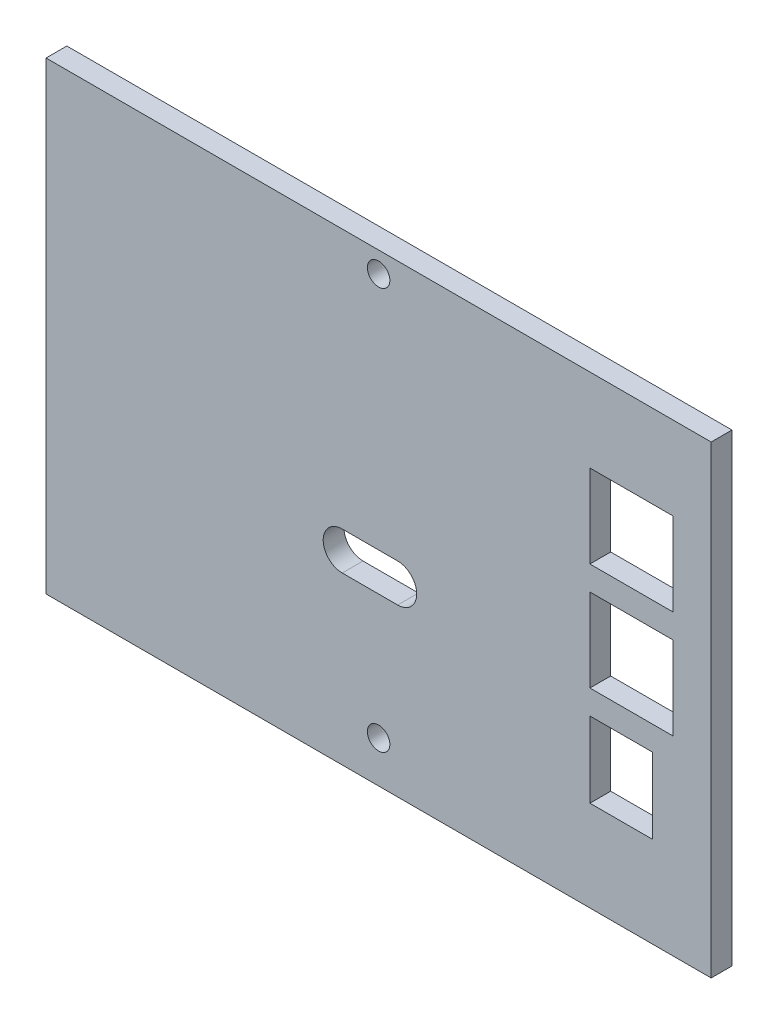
ISO-10303-21;
HEADER;
FILE_DESCRIPTION(('STEP AP214'),'2;1');
FILE_NAME('part.step','',(''),(''),'','','');
FILE_SCHEMA(('AUTOMOTIVE_DESIGN { 1 0 10303 214 1 1 1 1 }'));
ENDSEC;
DATA;
#1=APPLICATION_CONTEXT('core data for automotive mechanical design processes');
#2=APPLICATION_PROTOCOL_DEFINITION('international standard','automotive_design',2000,#1);
#3=PRODUCT_CONTEXT('',#1,'mechanical');
#4=PRODUCT('Part','Part','',(#3));
#5=PRODUCT_RELATED_PRODUCT_CATEGORY('part','',(#4));
#6=PRODUCT_DEFINITION_FORMATION('','',#4);
#7=PRODUCT_DEFINITION_CONTEXT('part definition',#1,'design');
#8=PRODUCT_DEFINITION('design','',#6,#7);
#9=PRODUCT_DEFINITION_SHAPE('','',#8);
#10=(LENGTH_UNIT() NAMED_UNIT(*) SI_UNIT(.MILLI.,.METRE.));
#11=(NAMED_UNIT(*) PLANE_ANGLE_UNIT() SI_UNIT($,.RADIAN.));
#12=(NAMED_UNIT(*) SI_UNIT($,.STERADIAN.) SOLID_ANGLE_UNIT());
#13=UNCERTAINTY_MEASURE_WITH_UNIT(LENGTH_MEASURE(1.E-05),#10,'distance_accuracy_value','');
#14=(GEOMETRIC_REPRESENTATION_CONTEXT(3) GLOBAL_UNCERTAINTY_ASSIGNED_CONTEXT((#13)) GLOBAL_UNIT_ASSIGNED_CONTEXT((#10,
#11,#12)) REPRESENTATION_CONTEXT('',''));
#15=CARTESIAN_POINT('',(0.,0.,0.));
#16=DIRECTION('',(0.,0.,1.));
#17=DIRECTION('',(1.,0.,0.));
#18=AXIS2_PLACEMENT_3D('',#15,#16,#17);
#19=CARTESIAN_POINT('',(0.,0.,3.));
#20=DIRECTION('',(0.,0.,-1.));
#21=DIRECTION('',(-1.,0.,0.));
#22=AXIS2_PLACEMENT_3D('',#19,#20,#21);
#23=PLANE('',#22);
#24=DIRECTION('',(0.,1.,0.));
#25=VECTOR('',#24,1.);
#26=CARTESIAN_POINT('',(39.5,-9.5,3.));
#27=LINE('',#26,#25);
#28=CARTESIAN_POINT('',(39.5,-20.4,3.));
#29=VERTEX_POINT('',#28);
#30=CARTESIAN_POINT('',(39.5,-9.5,3.));
#31=VERTEX_POINT('',#30);
#32=EDGE_CURVE('E228',#29,#31,#27,.T.);
#33=ORIENTED_EDGE('',*,*,#32,.F.);
#34=DIRECTION('',(1.,0.,0.));
#35=VECTOR('',#34,1.);
#36=CARTESIAN_POINT('',(30.5,-20.4,3.));
#37=LINE('',#36,#35);
#38=CARTESIAN_POINT('',(30.5,-20.4,3.));
#39=VERTEX_POINT('',#38);
#40=EDGE_CURVE('E223',#39,#29,#37,.T.);
#41=ORIENTED_EDGE('',*,*,#40,.F.);
#42=DIRECTION('',(0.,-1.,0.));
#43=VECTOR('',#42,1.);
#44=CARTESIAN_POINT('',(30.5,-9.5,3.));
#45=LINE('',#44,#43);
#46=CARTESIAN_POINT('',(30.5,-9.5,3.));
#47=VERTEX_POINT('',#46);
#48=EDGE_CURVE('E239',#47,#39,#45,.T.);
#49=ORIENTED_EDGE('',*,*,#48,.F.);
#50=DIRECTION('',(-1.,0.,0.));
#51=VECTOR('',#50,1.);
#52=CARTESIAN_POINT('',(30.5,-9.5,3.));
#53=LINE('',#52,#51);
#54=EDGE_CURVE('E241',#31,#47,#53,.T.);
#55=ORIENTED_EDGE('',*,*,#54,.F.);
#56=EDGE_LOOP('',(#33,#41,#49,#55));
#57=FACE_BOUND('',#56,.T.);
#58=DIRECTION('',(0.,-1.,0.));
#59=VECTOR('',#58,1.);
#60=CARTESIAN_POINT('',(30.5,21.5,3.));
#61=LINE('',#60,#59);
#62=CARTESIAN_POINT('',(30.5,21.5,3.));
#63=VERTEX_POINT('',#62);
#64=CARTESIAN_POINT('',(30.5,9.49999999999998,3.));
#65=VERTEX_POINT('',#64);
#66=EDGE_CURVE('E284',#63,#65,#61,.T.);
#67=ORIENTED_EDGE('',*,*,#66,.F.);
#68=DIRECTION('',(-1.,0.,0.));
#69=VECTOR('',#68,1.);
#70=CARTESIAN_POINT('',(42.5,21.5,3.));
#71=LINE('',#70,#69);
#72=CARTESIAN_POINT('',(42.5,21.5,3.));
#73=VERTEX_POINT('',#72);
#74=EDGE_CURVE('E292',#73,#63,#71,.T.);
#75=ORIENTED_EDGE('',*,*,#74,.F.);
#76=DIRECTION('',(0.,1.,0.));
#77=VECTOR('',#76,1.);
#78=CARTESIAN_POINT('',(42.5,21.5,3.));
#79=LINE('',#78,#77);
#80=CARTESIAN_POINT('',(42.5,9.49999999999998,3.));
#81=VERTEX_POINT('',#80);
#82=EDGE_CURVE('E289',#81,#73,#79,.T.);
#83=ORIENTED_EDGE('',*,*,#82,.F.);
#84=DIRECTION('',(1.,0.,0.));
#85=VECTOR('',#84,1.);
#86=CARTESIAN_POINT('',(42.5,9.49999999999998,3.));
#87=LINE('',#86,#85);
#88=EDGE_CURVE('E286',#65,#81,#87,.T.);
#89=ORIENTED_EDGE('',*,*,#88,.F.);
#90=EDGE_LOOP('',(#67,#75,#83,#89));
#91=FACE_BOUND('',#90,.T.);
#92=DIRECTION('',(0.,1.,0.));
#93=VECTOR('',#92,1.);
#94=CARTESIAN_POINT('',(48.,-33.5,3.));
#95=LINE('',#94,#93);
#96=CARTESIAN_POINT('',(48.,-33.5,3.));
#97=VERTEX_POINT('',#96);
#98=CARTESIAN_POINT('',(48.,33.5,3.));
#99=VERTEX_POINT('',#98);
#100=EDGE_CURVE('E315',#97,#99,#95,.T.);
#101=ORIENTED_EDGE('',*,*,#100,.T.);
#102=DIRECTION('',(-1.,0.,0.));
#103=VECTOR('',#102,1.);
#104=CARTESIAN_POINT('',(-48.,33.5,3.));
#105=LINE('',#104,#103);
#106=CARTESIAN_POINT('',(-48.,33.5,3.));
#107=VERTEX_POINT('',#106);
#108=EDGE_CURVE('E318',#99,#107,#105,.T.);
#109=ORIENTED_EDGE('',*,*,#108,.T.);
#110=DIRECTION('',(0.,-1.,0.));
#111=VECTOR('',#110,1.);
#112=CARTESIAN_POINT('',(-48.,-33.5,3.));
#113=LINE('',#112,#111);
#114=CARTESIAN_POINT('',(-48.,-33.5,3.));
#115=VERTEX_POINT('',#114);
#116=EDGE_CURVE('E321',#107,#115,#113,.T.);
#117=ORIENTED_EDGE('',*,*,#116,.T.);
#118=DIRECTION('',(1.,0.,0.));
#119=VECTOR('',#118,1.);
#120=CARTESIAN_POINT('',(-48.,-33.5,3.));
#121=LINE('',#120,#119);
#122=EDGE_CURVE('E323',#115,#97,#121,.T.);
#123=ORIENTED_EDGE('',*,*,#122,.T.);
#124=EDGE_LOOP('',(#101,#109,#117,#123));
#125=FACE_BOUND('',#124,.T.);
#126=DIRECTION('',(0.,-1.,0.));
#127=VECTOR('',#126,1.);
#128=CARTESIAN_POINT('',(30.5,5.99999999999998,3.));
#129=LINE('',#128,#127);
#130=CARTESIAN_POINT('',(30.5,5.99999999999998,3.));
#131=VERTEX_POINT('',#130);
#132=CARTESIAN_POINT('',(30.5,-6.00000000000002,3.));
#133=VERTEX_POINT('',#132);
#134=EDGE_CURVE('E195',#131,#133,#129,.T.);
#135=ORIENTED_EDGE('',*,*,#134,.F.);
#136=DIRECTION('',(-1.,0.,0.));
#137=VECTOR('',#136,1.);
#138=CARTESIAN_POINT('',(42.5,5.99999999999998,3.));
#139=LINE('',#138,#137);
#140=CARTESIAN_POINT('',(42.5,5.99999999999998,3.));
#141=VERTEX_POINT('',#140);
#142=EDGE_CURVE('E207',#141,#131,#139,.T.);
#143=ORIENTED_EDGE('',*,*,#142,.F.);
#144=DIRECTION('',(0.,1.,0.));
#145=VECTOR('',#144,1.);
#146=CARTESIAN_POINT('',(42.5,5.99999999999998,3.));
#147=LINE('',#146,#145);
#148=CARTESIAN_POINT('',(42.5,-6.00000000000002,3.));
#149=VERTEX_POINT('',#148);
#150=EDGE_CURVE('E182',#149,#141,#147,.T.);
#151=ORIENTED_EDGE('',*,*,#150,.F.);
#152=DIRECTION('',(1.,0.,0.));
#153=VECTOR('',#152,1.);
#154=CARTESIAN_POINT('',(42.5,-6.00000000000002,3.));
#155=LINE('',#154,#153);
#156=EDGE_CURVE('E210',#133,#149,#155,.T.);
#157=ORIENTED_EDGE('',*,*,#156,.F.);
#158=EDGE_LOOP('',(#135,#143,#151,#157));
#159=FACE_BOUND('',#158,.T.);
#160=CARTESIAN_POINT('',(2.75,-6.75,3.));
#161=DIRECTION('',(0.,0.,1.));
#162=DIRECTION('',(1.,0.,0.));
#163=AXIS2_PLACEMENT_3D('',#160,#161,#162);
#164=CIRCLE('',#163,2.75);
#165=CARTESIAN_POINT('',(2.75,-9.50000000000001,3.));
#166=VERTEX_POINT('',#165);
#167=CARTESIAN_POINT('',(2.75,-4.00000000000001,3.));
#168=VERTEX_POINT('',#167);
#169=EDGE_CURVE('E259',#166,#168,#164,.T.);
#170=ORIENTED_EDGE('',*,*,#169,.F.);
#171=DIRECTION('',(1.,0.,0.));
#172=VECTOR('',#171,1.);
#173=CARTESIAN_POINT('',(2.75,-9.50000000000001,3.));
#174=LINE('',#173,#172);
#175=CARTESIAN_POINT('',(-5.25,-9.50000000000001,3.));
#176=VERTEX_POINT('',#175);
#177=EDGE_CURVE('E254',#176,#166,#174,.T.);
#178=ORIENTED_EDGE('',*,*,#177,.F.);
#179=CARTESIAN_POINT('',(-5.25,-6.75000000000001,3.));
#180=DIRECTION('',(0.,0.,1.));
#181=DIRECTION('',(1.,0.,0.));
#182=AXIS2_PLACEMENT_3D('',#179,#180,#181);
#183=CIRCLE('',#182,2.75);
#184=CARTESIAN_POINT('',(-5.25,-4.,3.));
#185=VERTEX_POINT('',#184);
#186=EDGE_CURVE('E268',#185,#176,#183,.T.);
#187=ORIENTED_EDGE('',*,*,#186,.F.);
#188=DIRECTION('',(-1.,0.,0.));
#189=VECTOR('',#188,1.);
#190=CARTESIAN_POINT('',(2.75,-4.00000000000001,3.));
#191=LINE('',#190,#189);
#192=EDGE_CURVE('E270',#168,#185,#191,.T.);
#193=ORIENTED_EDGE('',*,*,#192,.F.);
#194=EDGE_LOOP('',(#170,#178,#187,#193));
#195=FACE_BOUND('',#194,.T.);
#196=CARTESIAN_POINT('',(0.,-27.5000000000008,3.));
#197=DIRECTION('',(0.,0.,1.));
#198=DIRECTION('',(1.,0.,0.));
#199=AXIS2_PLACEMENT_3D('',#196,#197,#198);
#200=CIRCLE('',#199,1.625);
#201=CARTESIAN_POINT('',(1.62500000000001,-27.5000000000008,3.));
#202=VERTEX_POINT('',#201);
#203=EDGE_CURVE('E275',#202,#202,#200,.T.);
#204=ORIENTED_EDGE('',*,*,#203,.F.);
#205=EDGE_LOOP('',(#204));
#206=FACE_BOUND('',#205,.T.);
#207=CARTESIAN_POINT('',(0.,30.5,3.));
#208=DIRECTION('',(0.,0.,1.));
#209=DIRECTION('',(1.,0.,0.));
#210=AXIS2_PLACEMENT_3D('',#207,#208,#209);
#211=CIRCLE('',#210,1.625);
#212=CARTESIAN_POINT('',(1.62499999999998,30.5,3.));
#213=VERTEX_POINT('',#212);
#214=EDGE_CURVE('E281',#213,#213,#211,.T.);
#215=ORIENTED_EDGE('',*,*,#214,.F.);
#216=EDGE_LOOP('',(#215));
#217=FACE_BOUND('',#216,.T.);
#218=ADVANCED_FACE('F37',(#57,#91,#125,#159,#195,#206,#217),#23,.F.);
#219=CARTESIAN_POINT('',(0.,0.,0.));
#220=DIRECTION('',(0.,0.,-1.));
#221=DIRECTION('',(-1.,0.,0.));
#222=AXIS2_PLACEMENT_3D('',#219,#220,#221);
#223=PLANE('',#222);
#224=CARTESIAN_POINT('',(0.,-27.5000000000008,0.));
#225=DIRECTION('',(0.,0.,1.));
#226=DIRECTION('',(1.,0.,0.));
#227=AXIS2_PLACEMENT_3D('',#224,#225,#226);
#228=CIRCLE('',#227,1.625);
#229=CARTESIAN_POINT('',(1.62500000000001,-27.5000000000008,0.));
#230=VERTEX_POINT('',#229);
#231=EDGE_CURVE('E248',#230,#230,#228,.T.);
#232=ORIENTED_EDGE('',*,*,#231,.T.);
#233=EDGE_LOOP('',(#232));
#234=FACE_BOUND('',#233,.T.);
#235=DIRECTION('',(0.,1.,0.));
#236=VECTOR('',#235,1.);
#237=CARTESIAN_POINT('',(48.,-33.5,0.));
#238=LINE('',#237,#236);
#239=CARTESIAN_POINT('',(48.,-33.5,0.));
#240=VERTEX_POINT('',#239);
#241=CARTESIAN_POINT('',(48.,33.5,0.));
#242=VERTEX_POINT('',#241);
#243=EDGE_CURVE('E314',#240,#242,#238,.T.);
#244=ORIENTED_EDGE('',*,*,#243,.F.);
#245=DIRECTION('',(1.,0.,0.));
#246=VECTOR('',#245,1.);
#247=CARTESIAN_POINT('',(-48.,-33.5,0.));
#248=LINE('',#247,#246);
#249=CARTESIAN_POINT('',(-48.,-33.5,0.));
#250=VERTEX_POINT('',#249);
#251=EDGE_CURVE('E319',#250,#240,#248,.T.);
#252=ORIENTED_EDGE('',*,*,#251,.F.);
#253=DIRECTION('',(0.,-1.,0.));
#254=VECTOR('',#253,1.);
#255=CARTESIAN_POINT('',(-48.,-33.5,0.));
#256=LINE('',#255,#254);
#257=CARTESIAN_POINT('',(-48.,33.5,0.));
#258=VERTEX_POINT('',#257);
#259=EDGE_CURVE('E330',#258,#250,#256,.T.);
#260=ORIENTED_EDGE('',*,*,#259,.F.);
#261=DIRECTION('',(-1.,0.,0.));
#262=VECTOR('',#261,1.);
#263=CARTESIAN_POINT('',(-48.,33.5,0.));
#264=LINE('',#263,#262);
#265=EDGE_CURVE('E328',#242,#258,#264,.T.);
#266=ORIENTED_EDGE('',*,*,#265,.F.);
#267=EDGE_LOOP('',(#244,#252,#260,#266));
#268=FACE_BOUND('',#267,.T.);
#269=DIRECTION('',(-1.,0.,0.));
#270=VECTOR('',#269,1.);
#271=CARTESIAN_POINT('',(42.5,21.5,0.));
#272=LINE('',#271,#270);
#273=CARTESIAN_POINT('',(42.5,21.5,0.));
#274=VERTEX_POINT('',#273);
#275=CARTESIAN_POINT('',(30.5,21.5,0.));
#276=VERTEX_POINT('',#275);
#277=EDGE_CURVE('E287',#274,#276,#272,.T.);
#278=ORIENTED_EDGE('',*,*,#277,.T.);
#279=DIRECTION('',(0.,-1.,0.));
#280=VECTOR('',#279,1.);
#281=CARTESIAN_POINT('',(30.5,21.5,0.));
#282=LINE('',#281,#280);
#283=CARTESIAN_POINT('',(30.5,9.49999999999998,0.));
#284=VERTEX_POINT('',#283);
#285=EDGE_CURVE('E206',#276,#284,#282,.T.);
#286=ORIENTED_EDGE('',*,*,#285,.T.);
#287=DIRECTION('',(1.,0.,0.));
#288=VECTOR('',#287,1.);
#289=CARTESIAN_POINT('',(42.5,9.49999999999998,0.));
#290=LINE('',#289,#288);
#291=CARTESIAN_POINT('',(42.5,9.49999999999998,0.));
#292=VERTEX_POINT('',#291);
#293=EDGE_CURVE('E297',#284,#292,#290,.T.);
#294=ORIENTED_EDGE('',*,*,#293,.T.);
#295=DIRECTION('',(0.,1.,0.));
#296=VECTOR('',#295,1.);
#297=CARTESIAN_POINT('',(42.5,21.5,0.));
#298=LINE('',#297,#296);
#299=EDGE_CURVE('E300',#292,#274,#298,.T.);
#300=ORIENTED_EDGE('',*,*,#299,.T.);
#301=EDGE_LOOP('',(#278,#286,#294,#300));
#302=FACE_BOUND('',#301,.T.);
#303=DIRECTION('',(-1.,0.,0.));
#304=VECTOR('',#303,1.);
#305=CARTESIAN_POINT('',(42.5,5.99999999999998,0.));
#306=LINE('',#305,#304);
#307=CARTESIAN_POINT('',(42.5,5.99999999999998,0.));
#308=VERTEX_POINT('',#307);
#309=CARTESIAN_POINT('',(30.5,5.99999999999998,0.));
#310=VERTEX_POINT('',#309);
#311=EDGE_CURVE('E190',#308,#310,#306,.T.);
#312=ORIENTED_EDGE('',*,*,#311,.T.);
#313=DIRECTION('',(0.,-1.,0.));
#314=VECTOR('',#313,1.);
#315=CARTESIAN_POINT('',(30.5,5.99999999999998,0.));
#316=LINE('',#315,#314);
#317=CARTESIAN_POINT('',(30.5,-6.00000000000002,0.));
#318=VERTEX_POINT('',#317);
#319=EDGE_CURVE('E201',#310,#318,#316,.T.);
#320=ORIENTED_EDGE('',*,*,#319,.T.);
#321=DIRECTION('',(1.,0.,0.));
#322=VECTOR('',#321,1.);
#323=CARTESIAN_POINT('',(42.5,-6.00000000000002,0.));
#324=LINE('',#323,#322);
#325=CARTESIAN_POINT('',(42.5,-6.00000000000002,0.));
#326=VERTEX_POINT('',#325);
#327=EDGE_CURVE('E199',#318,#326,#324,.T.);
#328=ORIENTED_EDGE('',*,*,#327,.T.);
#329=DIRECTION('',(0.,1.,0.));
#330=VECTOR('',#329,1.);
#331=CARTESIAN_POINT('',(42.5,5.99999999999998,0.));
#332=LINE('',#331,#330);
#333=EDGE_CURVE('E179',#326,#308,#332,.T.);
#334=ORIENTED_EDGE('',*,*,#333,.T.);
#335=EDGE_LOOP('',(#312,#320,#328,#334));
#336=FACE_BOUND('',#335,.T.);
#337=DIRECTION('',(1.,0.,0.));
#338=VECTOR('',#337,1.);
#339=CARTESIAN_POINT('',(30.5,-20.4,0.));
#340=LINE('',#339,#338);
#341=CARTESIAN_POINT('',(30.5,-20.4,0.));
#342=VERTEX_POINT('',#341);
#343=CARTESIAN_POINT('',(39.5,-20.4,0.));
#344=VERTEX_POINT('',#343);
#345=EDGE_CURVE('E224',#342,#344,#340,.T.);
#346=ORIENTED_EDGE('',*,*,#345,.T.);
#347=DIRECTION('',(0.,1.,0.));
#348=VECTOR('',#347,1.);
#349=CARTESIAN_POINT('',(39.5,-9.5,0.));
#350=LINE('',#349,#348);
#351=CARTESIAN_POINT('',(39.5,-9.5,0.));
#352=VERTEX_POINT('',#351);
#353=EDGE_CURVE('E234',#344,#352,#350,.T.);
#354=ORIENTED_EDGE('',*,*,#353,.T.);
#355=DIRECTION('',(-1.,0.,0.));
#356=VECTOR('',#355,1.);
#357=CARTESIAN_POINT('',(30.5,-9.5,0.));
#358=LINE('',#357,#356);
#359=CARTESIAN_POINT('',(30.5,-9.5,0.));
#360=VERTEX_POINT('',#359);
#361=EDGE_CURVE('E231',#352,#360,#358,.T.);
#362=ORIENTED_EDGE('',*,*,#361,.T.);
#363=DIRECTION('',(0.,-1.,0.));
#364=VECTOR('',#363,1.);
#365=CARTESIAN_POINT('',(30.5,-9.5,0.));
#366=LINE('',#365,#364);
#367=EDGE_CURVE('E227',#360,#342,#366,.T.);
#368=ORIENTED_EDGE('',*,*,#367,.T.);
#369=EDGE_LOOP('',(#346,#354,#362,#368));
#370=FACE_BOUND('',#369,.T.);
#371=DIRECTION('',(1.,0.,0.));
#372=VECTOR('',#371,1.);
#373=CARTESIAN_POINT('',(2.75,-9.50000000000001,0.));
#374=LINE('',#373,#372);
#375=CARTESIAN_POINT('',(-5.25,-9.50000000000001,0.));
#376=VERTEX_POINT('',#375);
#377=CARTESIAN_POINT('',(2.75,-9.50000000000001,0.));
#378=VERTEX_POINT('',#377);
#379=EDGE_CURVE('E255',#376,#378,#374,.T.);
#380=ORIENTED_EDGE('',*,*,#379,.T.);
#381=CARTESIAN_POINT('',(2.75,-6.75,0.));
#382=DIRECTION('',(0.,0.,1.));
#383=DIRECTION('',(1.,0.,0.));
#384=AXIS2_PLACEMENT_3D('',#381,#382,#383);
#385=CIRCLE('',#384,2.75);
#386=CARTESIAN_POINT('',(2.75,-4.00000000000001,0.));
#387=VERTEX_POINT('',#386);
#388=EDGE_CURVE('E217',#378,#387,#385,.T.);
#389=ORIENTED_EDGE('',*,*,#388,.T.);
#390=DIRECTION('',(-1.,0.,0.));
#391=VECTOR('',#390,1.);
#392=CARTESIAN_POINT('',(2.75,-4.00000000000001,0.));
#393=LINE('',#392,#391);
#394=CARTESIAN_POINT('',(-5.25,-4.,0.));
#395=VERTEX_POINT('',#394);
#396=EDGE_CURVE('E262',#387,#395,#393,.T.);
#397=ORIENTED_EDGE('',*,*,#396,.T.);
#398=CARTESIAN_POINT('',(-5.25,-6.75000000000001,0.));
#399=DIRECTION('',(0.,0.,1.));
#400=DIRECTION('',(1.,0.,0.));
#401=AXIS2_PLACEMENT_3D('',#398,#399,#400);
#402=CIRCLE('',#401,2.75);
#403=EDGE_CURVE('E258',#395,#376,#402,.T.);
#404=ORIENTED_EDGE('',*,*,#403,.T.);
#405=EDGE_LOOP('',(#380,#389,#397,#404));
#406=FACE_BOUND('',#405,.T.);
#407=CARTESIAN_POINT('',(0.,30.5,0.));
#408=DIRECTION('',(0.,0.,1.));
#409=DIRECTION('',(1.,0.,0.));
#410=AXIS2_PLACEMENT_3D('',#407,#408,#409);
#411=CIRCLE('',#410,1.625);
#412=CARTESIAN_POINT('',(1.62499999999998,30.5,0.));
#413=VERTEX_POINT('',#412);
#414=EDGE_CURVE('E278',#413,#413,#411,.T.);
#415=ORIENTED_EDGE('',*,*,#414,.T.);
#416=EDGE_LOOP('',(#415));
#417=FACE_BOUND('',#416,.T.);
#418=ADVANCED_FACE('F197',(#234,#268,#302,#336,#370,#406,#417),#223,.T.);
#419=CARTESIAN_POINT('',(48.,-33.5,3.));
#420=DIRECTION('',(-1.,0.,0.));
#421=DIRECTION('',(0.,0.,1.));
#422=AXIS2_PLACEMENT_3D('',#419,#420,#421);
#423=PLANE('',#422);
#424=ORIENTED_EDGE('',*,*,#243,.T.);
#425=DIRECTION('',(0.,0.,-1.));
#426=VECTOR('',#425,1.);
#427=CARTESIAN_POINT('',(48.,33.5,3.));
#428=LINE('',#427,#426);
#429=EDGE_CURVE('E11',#99,#242,#428,.T.);
#430=ORIENTED_EDGE('',*,*,#429,.F.);
#431=ORIENTED_EDGE('',*,*,#100,.F.);
#432=DIRECTION('',(0.,0.,-1.));
#433=VECTOR('',#432,1.);
#434=CARTESIAN_POINT('',(48.,-33.5,3.));
#435=LINE('',#434,#433);
#436=EDGE_CURVE('E325',#97,#240,#435,.T.);
#437=ORIENTED_EDGE('',*,*,#436,.T.);
#438=EDGE_LOOP('',(#424,#430,#431,#437));
#439=FACE_BOUND('',#438,.T.);
#440=ADVANCED_FACE('F39',(#439),#423,.F.);
#441=CARTESIAN_POINT('',(-48.,33.5,3.));
#442=DIRECTION('',(0.,-1.,0.));
#443=DIRECTION('',(0.,0.,-1.));
#444=AXIS2_PLACEMENT_3D('',#441,#442,#443);
#445=PLANE('',#444);
#446=ORIENTED_EDGE('',*,*,#265,.T.);
#447=DIRECTION('',(0.,0.,-1.));
#448=VECTOR('',#447,1.);
#449=CARTESIAN_POINT('',(-48.,33.5,3.));
#450=LINE('',#449,#448);
#451=EDGE_CURVE('E45',#107,#258,#450,.T.);
#452=ORIENTED_EDGE('',*,*,#451,.F.);
#453=ORIENTED_EDGE('',*,*,#108,.F.);
#454=ORIENTED_EDGE('',*,*,#429,.T.);
#455=EDGE_LOOP('',(#446,#452,#453,#454));
#456=FACE_BOUND('',#455,.T.);
#457=ADVANCED_FACE('F358',(#456),#445,.F.);
#458=CARTESIAN_POINT('',(-48.,-33.5,3.));
#459=DIRECTION('',(1.,0.,0.));
#460=DIRECTION('',(0.,0.,-1.));
#461=AXIS2_PLACEMENT_3D('',#458,#459,#460);
#462=PLANE('',#461);
#463=ORIENTED_EDGE('',*,*,#259,.T.);
#464=DIRECTION('',(0.,0.,-1.));
#465=VECTOR('',#464,1.);
#466=CARTESIAN_POINT('',(-48.,-33.5,3.));
#467=LINE('',#466,#465);
#468=EDGE_CURVE('E335',#115,#250,#467,.T.);
#469=ORIENTED_EDGE('',*,*,#468,.F.);
#470=ORIENTED_EDGE('',*,*,#116,.F.);
#471=ORIENTED_EDGE('',*,*,#451,.T.);
#472=EDGE_LOOP('',(#463,#469,#470,#471));
#473=FACE_BOUND('',#472,.T.);
#474=ADVANCED_FACE('F342',(#473),#462,.F.);
#475=CARTESIAN_POINT('',(-48.,-33.5,3.));
#476=DIRECTION('',(0.,1.,0.));
#477=DIRECTION('',(0.,0.,1.));
#478=AXIS2_PLACEMENT_3D('',#475,#476,#477);
#479=PLANE('',#478);
#480=ORIENTED_EDGE('',*,*,#251,.T.);
#481=ORIENTED_EDGE('',*,*,#436,.F.);
#482=ORIENTED_EDGE('',*,*,#122,.F.);
#483=ORIENTED_EDGE('',*,*,#468,.T.);
#484=EDGE_LOOP('',(#480,#481,#482,#483));
#485=FACE_BOUND('',#484,.T.);
#486=ADVANCED_FACE('F351',(#485),#479,.F.);
#487=CARTESIAN_POINT('',(30.5,21.5,3.));
#488=DIRECTION('',(1.,0.,0.));
#489=DIRECTION('',(0.,0.,-1.));
#490=AXIS2_PLACEMENT_3D('',#487,#488,#489);
#491=PLANE('',#490);
#492=ORIENTED_EDGE('',*,*,#285,.F.);
#493=DIRECTION('',(0.,0.,-1.));
#494=VECTOR('',#493,1.);
#495=CARTESIAN_POINT('',(30.5,21.5,3.));
#496=LINE('',#495,#494);
#497=EDGE_CURVE('E294',#63,#276,#496,.T.);
#498=ORIENTED_EDGE('',*,*,#497,.F.);
#499=ORIENTED_EDGE('',*,*,#66,.T.);
#500=DIRECTION('',(0.,0.,-1.));
#501=VECTOR('',#500,1.);
#502=CARTESIAN_POINT('',(30.5,9.49999999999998,3.));
#503=LINE('',#502,#501);
#504=EDGE_CURVE('E311',#65,#284,#503,.T.);
#505=ORIENTED_EDGE('',*,*,#504,.T.);
#506=EDGE_LOOP('',(#492,#498,#499,#505));
#507=FACE_BOUND('',#506,.T.);
#508=ADVANCED_FACE('F376',(#507),#491,.T.);
#509=CARTESIAN_POINT('',(42.5,9.49999999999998,3.));
#510=DIRECTION('',(0.,1.,0.));
#511=DIRECTION('',(-1.,0.,0.));
#512=AXIS2_PLACEMENT_3D('',#509,#510,#511);
#513=PLANE('',#512);
#514=ORIENTED_EDGE('',*,*,#293,.F.);
#515=ORIENTED_EDGE('',*,*,#504,.F.);
#516=ORIENTED_EDGE('',*,*,#88,.T.);
#517=DIRECTION('',(0.,0.,-1.));
#518=VECTOR('',#517,1.);
#519=CARTESIAN_POINT('',(42.5,9.49999999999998,3.));
#520=LINE('',#519,#518);
#521=EDGE_CURVE('E309',#81,#292,#520,.T.);
#522=ORIENTED_EDGE('',*,*,#521,.T.);
#523=EDGE_LOOP('',(#514,#515,#516,#522));
#524=FACE_BOUND('',#523,.T.);
#525=ADVANCED_FACE('F383',(#524),#513,.T.);
#526=CARTESIAN_POINT('',(42.5,21.5,3.));
#527=DIRECTION('',(-1.,0.,0.));
#528=DIRECTION('',(0.,0.,1.));
#529=AXIS2_PLACEMENT_3D('',#526,#527,#528);
#530=PLANE('',#529);
#531=ORIENTED_EDGE('',*,*,#299,.F.);
#532=ORIENTED_EDGE('',*,*,#521,.F.);
#533=ORIENTED_EDGE('',*,*,#82,.T.);
#534=DIRECTION('',(0.,0.,-1.));
#535=VECTOR('',#534,1.);
#536=CARTESIAN_POINT('',(42.5,21.5,3.));
#537=LINE('',#536,#535);
#538=EDGE_CURVE('E307',#73,#274,#537,.T.);
#539=ORIENTED_EDGE('',*,*,#538,.T.);
#540=EDGE_LOOP('',(#531,#532,#533,#539));
#541=FACE_BOUND('',#540,.T.);
#542=ADVANCED_FACE('F388',(#541),#530,.T.);
#543=CARTESIAN_POINT('',(42.5,21.5,3.));
#544=DIRECTION('',(0.,-1.,0.));
#545=DIRECTION('',(0.,0.,-1.));
#546=AXIS2_PLACEMENT_3D('',#543,#544,#545);
#547=PLANE('',#546);
#548=ORIENTED_EDGE('',*,*,#277,.F.);
#549=ORIENTED_EDGE('',*,*,#538,.F.);
#550=ORIENTED_EDGE('',*,*,#74,.T.);
#551=ORIENTED_EDGE('',*,*,#497,.T.);
#552=EDGE_LOOP('',(#548,#549,#550,#551));
#553=FACE_BOUND('',#552,.T.);
#554=ADVANCED_FACE('F395',(#553),#547,.T.);
#555=CARTESIAN_POINT('',(30.5,5.99999999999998,3.));
#556=DIRECTION('',(1.,0.,0.));
#557=DIRECTION('',(0.,1.,0.));
#558=AXIS2_PLACEMENT_3D('',#555,#556,#557);
#559=PLANE('',#558);
#560=ORIENTED_EDGE('',*,*,#319,.F.);
#561=DIRECTION('',(0.,0.,-1.));
#562=VECTOR('',#561,1.);
#563=CARTESIAN_POINT('',(30.5,5.99999999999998,3.));
#564=LINE('',#563,#562);
#565=EDGE_CURVE('E185',#131,#310,#564,.T.);
#566=ORIENTED_EDGE('',*,*,#565,.F.);
#567=ORIENTED_EDGE('',*,*,#134,.T.);
#568=DIRECTION('',(0.,0.,-1.));
#569=VECTOR('',#568,1.);
#570=CARTESIAN_POINT('',(30.5,-6.00000000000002,3.));
#571=LINE('',#570,#569);
#572=EDGE_CURVE('E237',#133,#318,#571,.T.);
#573=ORIENTED_EDGE('',*,*,#572,.T.);
#574=EDGE_LOOP('',(#560,#566,#567,#573));
#575=FACE_BOUND('',#574,.T.);
#576=ADVANCED_FACE('F407',(#575),#559,.T.);
#577=CARTESIAN_POINT('',(42.5,-6.00000000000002,3.));
#578=DIRECTION('',(0.,1.,0.));
#579=DIRECTION('',(-1.,0.,0.));
#580=AXIS2_PLACEMENT_3D('',#577,#578,#579);
#581=PLANE('',#580);
#582=ORIENTED_EDGE('',*,*,#327,.F.);
#583=ORIENTED_EDGE('',*,*,#572,.F.);
#584=ORIENTED_EDGE('',*,*,#156,.T.);
#585=DIRECTION('',(0.,0.,-1.));
#586=VECTOR('',#585,1.);
#587=CARTESIAN_POINT('',(42.5,-6.00000000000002,3.));
#588=LINE('',#587,#586);
#589=EDGE_CURVE('E186',#149,#326,#588,.T.);
#590=ORIENTED_EDGE('',*,*,#589,.T.);
#591=EDGE_LOOP('',(#582,#583,#584,#590));
#592=FACE_BOUND('',#591,.T.);
#593=ADVANCED_FACE('F452',(#592),#581,.T.);
#594=CARTESIAN_POINT('',(42.5,5.99999999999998,3.));
#595=DIRECTION('',(-1.,0.,0.));
#596=DIRECTION('',(0.,0.,1.));
#597=AXIS2_PLACEMENT_3D('',#594,#595,#596);
#598=PLANE('',#597);
#599=ORIENTED_EDGE('',*,*,#333,.F.);
#600=ORIENTED_EDGE('',*,*,#589,.F.);
#601=ORIENTED_EDGE('',*,*,#150,.T.);
#602=DIRECTION('',(0.,0.,-1.));
#603=VECTOR('',#602,1.);
#604=CARTESIAN_POINT('',(42.5,5.99999999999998,3.));
#605=LINE('',#604,#603);
#606=EDGE_CURVE('E174',#141,#308,#605,.T.);
#607=ORIENTED_EDGE('',*,*,#606,.T.);
#608=EDGE_LOOP('',(#599,#600,#601,#607));
#609=FACE_BOUND('',#608,.T.);
#610=ADVANCED_FACE('F176',(#609),#598,.T.);
#611=CARTESIAN_POINT('',(42.5,5.99999999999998,3.));
#612=DIRECTION('',(0.,-1.,0.));
#613=DIRECTION('',(1.,0.,0.));
#614=AXIS2_PLACEMENT_3D('',#611,#612,#613);
#615=PLANE('',#614);
#616=ORIENTED_EDGE('',*,*,#311,.F.);
#617=ORIENTED_EDGE('',*,*,#606,.F.);
#618=ORIENTED_EDGE('',*,*,#142,.T.);
#619=ORIENTED_EDGE('',*,*,#565,.T.);
#620=EDGE_LOOP('',(#616,#617,#618,#619));
#621=FACE_BOUND('',#620,.T.);
#622=ADVANCED_FACE('F191',(#621),#615,.T.);
#623=CARTESIAN_POINT('',(39.5,-9.5,3.));
#624=DIRECTION('',(-1.,0.,0.));
#625=DIRECTION('',(0.,0.,1.));
#626=AXIS2_PLACEMENT_3D('',#623,#624,#625);
#627=PLANE('',#626);
#628=ORIENTED_EDGE('',*,*,#353,.F.);
#629=DIRECTION('',(0.,0.,-1.));
#630=VECTOR('',#629,1.);
#631=CARTESIAN_POINT('',(39.5,-20.4,3.));
#632=LINE('',#631,#630);
#633=EDGE_CURVE('E220',#29,#344,#632,.T.);
#634=ORIENTED_EDGE('',*,*,#633,.F.);
#635=ORIENTED_EDGE('',*,*,#32,.T.);
#636=DIRECTION('',(0.,0.,-1.));
#637=VECTOR('',#636,1.);
#638=CARTESIAN_POINT('',(39.5,-9.5,3.));
#639=LINE('',#638,#637);
#640=EDGE_CURVE('E213',#31,#352,#639,.T.);
#641=ORIENTED_EDGE('',*,*,#640,.T.);
#642=EDGE_LOOP('',(#628,#634,#635,#641));
#643=FACE_BOUND('',#642,.T.);
#644=ADVANCED_FACE('F443',(#643),#627,.T.);
#645=CARTESIAN_POINT('',(30.5,-9.5,3.));
#646=DIRECTION('',(0.,-1.,0.));
#647=DIRECTION('',(0.,0.,-1.));
#648=AXIS2_PLACEMENT_3D('',#645,#646,#647);
#649=PLANE('',#648);
#650=ORIENTED_EDGE('',*,*,#361,.F.);
#651=ORIENTED_EDGE('',*,*,#640,.F.);
#652=ORIENTED_EDGE('',*,*,#54,.T.);
#653=DIRECTION('',(0.,0.,-1.));
#654=VECTOR('',#653,1.);
#655=CARTESIAN_POINT('',(30.5,-9.5,3.));
#656=LINE('',#655,#654);
#657=EDGE_CURVE('E216',#47,#360,#656,.T.);
#658=ORIENTED_EDGE('',*,*,#657,.T.);
#659=EDGE_LOOP('',(#650,#651,#652,#658));
#660=FACE_BOUND('',#659,.T.);
#661=ADVANCED_FACE('F439',(#660),#649,.T.);
#662=CARTESIAN_POINT('',(30.5,-9.5,3.));
#663=DIRECTION('',(1.,0.,0.));
#664=DIRECTION('',(0.,0.,-1.));
#665=AXIS2_PLACEMENT_3D('',#662,#663,#664);
#666=PLANE('',#665);
#667=ORIENTED_EDGE('',*,*,#367,.F.);
#668=ORIENTED_EDGE('',*,*,#657,.F.);
#669=ORIENTED_EDGE('',*,*,#48,.T.);
#670=DIRECTION('',(0.,0.,-1.));
#671=VECTOR('',#670,1.);
#672=CARTESIAN_POINT('',(30.5,-20.4,3.));
#673=LINE('',#672,#671);
#674=EDGE_CURVE('E60',#39,#342,#673,.T.);
#675=ORIENTED_EDGE('',*,*,#674,.T.);
#676=EDGE_LOOP('',(#667,#668,#669,#675));
#677=FACE_BOUND('',#676,.T.);
#678=ADVANCED_FACE('F436',(#677),#666,.T.);
#679=CARTESIAN_POINT('',(30.5,-20.4,3.));
#680=DIRECTION('',(0.,1.,0.));
#681=DIRECTION('',(0.,0.,1.));
#682=AXIS2_PLACEMENT_3D('',#679,#680,#681);
#683=PLANE('',#682);
#684=ORIENTED_EDGE('',*,*,#345,.F.);
#685=ORIENTED_EDGE('',*,*,#674,.F.);
#686=ORIENTED_EDGE('',*,*,#40,.T.);
#687=ORIENTED_EDGE('',*,*,#633,.T.);
#688=EDGE_LOOP('',(#684,#685,#686,#687));
#689=FACE_BOUND('',#688,.T.);
#690=ADVANCED_FACE('F432',(#689),#683,.T.);
#691=CARTESIAN_POINT('',(2.75,-6.75,3.));
#692=DIRECTION('',(0.,0.,-1.));
#693=DIRECTION('',(-1.,0.,0.));
#694=AXIS2_PLACEMENT_3D('',#691,#692,#693);
#695=CYLINDRICAL_SURFACE('',#694,2.75);
#696=ORIENTED_EDGE('',*,*,#388,.F.);
#697=DIRECTION('',(0.,0.,-1.));
#698=VECTOR('',#697,1.);
#699=CARTESIAN_POINT('',(2.75,-9.50000000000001,3.));
#700=LINE('',#699,#698);
#701=EDGE_CURVE('E251',#166,#378,#700,.T.);
#702=ORIENTED_EDGE('',*,*,#701,.F.);
#703=ORIENTED_EDGE('',*,*,#169,.T.);
#704=DIRECTION('',(0.,0.,-1.));
#705=VECTOR('',#704,1.);
#706=CARTESIAN_POINT('',(2.75,-4.00000000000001,3.));
#707=LINE('',#706,#705);
#708=EDGE_CURVE('E244',#168,#387,#707,.T.);
#709=ORIENTED_EDGE('',*,*,#708,.T.);
#710=EDGE_LOOP('',(#696,#702,#703,#709));
#711=FACE_BOUND('',#710,.T.);
#712=ADVANCED_FACE('F428',(#711),#695,.F.);
#713=CARTESIAN_POINT('',(2.75,-4.00000000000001,3.));
#714=DIRECTION('',(0.,-1.,0.));
#715=DIRECTION('',(1.,0.,0.));
#716=AXIS2_PLACEMENT_3D('',#713,#714,#715);
#717=PLANE('',#716);
#718=ORIENTED_EDGE('',*,*,#396,.F.);
#719=ORIENTED_EDGE('',*,*,#708,.F.);
#720=ORIENTED_EDGE('',*,*,#192,.T.);
#721=DIRECTION('',(0.,0.,-1.));
#722=VECTOR('',#721,1.);
#723=CARTESIAN_POINT('',(-5.25,-4.,3.));
#724=LINE('',#723,#722);
#725=EDGE_CURVE('E247',#185,#395,#724,.T.);
#726=ORIENTED_EDGE('',*,*,#725,.T.);
#727=EDGE_LOOP('',(#718,#719,#720,#726));
#728=FACE_BOUND('',#727,.T.);
#729=ADVANCED_FACE('F424',(#728),#717,.T.);
#730=CARTESIAN_POINT('',(-5.25,-6.75000000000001,3.));
#731=DIRECTION('',(0.,0.,-1.));
#732=DIRECTION('',(-1.,0.,0.));
#733=AXIS2_PLACEMENT_3D('',#730,#731,#732);
#734=CYLINDRICAL_SURFACE('',#733,2.75);
#735=ORIENTED_EDGE('',*,*,#403,.F.);
#736=ORIENTED_EDGE('',*,*,#725,.F.);
#737=ORIENTED_EDGE('',*,*,#186,.T.);
#738=DIRECTION('',(0.,0.,-1.));
#739=VECTOR('',#738,1.);
#740=CARTESIAN_POINT('',(-5.25,-9.50000000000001,3.));
#741=LINE('',#740,#739);
#742=EDGE_CURVE('E52',#176,#376,#741,.T.);
#743=ORIENTED_EDGE('',*,*,#742,.T.);
#744=EDGE_LOOP('',(#735,#736,#737,#743));
#745=FACE_BOUND('',#744,.T.);
#746=ADVANCED_FACE('F421',(#745),#734,.F.);
#747=CARTESIAN_POINT('',(2.75,-9.50000000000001,3.));
#748=DIRECTION('',(0.,1.,0.));
#749=DIRECTION('',(-1.,0.,0.));
#750=AXIS2_PLACEMENT_3D('',#747,#748,#749);
#751=PLANE('',#750);
#752=ORIENTED_EDGE('',*,*,#379,.F.);
#753=ORIENTED_EDGE('',*,*,#742,.F.);
#754=ORIENTED_EDGE('',*,*,#177,.T.);
#755=ORIENTED_EDGE('',*,*,#701,.T.);
#756=EDGE_LOOP('',(#752,#753,#754,#755));
#757=FACE_BOUND('',#756,.T.);
#758=ADVANCED_FACE('F417',(#757),#751,.T.);
#759=CARTESIAN_POINT('',(0.,-27.5000000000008,3.));
#760=DIRECTION('',(0.,0.,-1.));
#761=DIRECTION('',(-1.,0.,0.));
#762=AXIS2_PLACEMENT_3D('',#759,#760,#761);
#763=CYLINDRICAL_SURFACE('',#762,1.625);
#764=ORIENTED_EDGE('',*,*,#203,.T.);
#765=EDGE_LOOP('',(#764));
#766=FACE_BOUND('',#765,.T.);
#767=ORIENTED_EDGE('',*,*,#231,.F.);
#768=EDGE_LOOP('',(#767));
#769=FACE_BOUND('',#768,.T.);
#770=ADVANCED_FACE('F413',(#766,#769),#763,.F.);
#771=CARTESIAN_POINT('',(0.,30.5,3.));
#772=DIRECTION('',(0.,0.,-1.));
#773=DIRECTION('',(-1.,0.,0.));
#774=AXIS2_PLACEMENT_3D('',#771,#772,#773);
#775=CYLINDRICAL_SURFACE('',#774,1.625);
#776=ORIENTED_EDGE('',*,*,#214,.T.);
#777=EDGE_LOOP('',(#776));
#778=FACE_BOUND('',#777,.T.);
#779=ORIENTED_EDGE('',*,*,#414,.F.);
#780=EDGE_LOOP('',(#779));
#781=FACE_BOUND('',#780,.T.);
#782=ADVANCED_FACE('F410',(#778,#781),#775,.F.);
#783=CLOSED_SHELL('',(#218,#418,#440,#457,#474,#486,#508,#525,#542,#554,#576,#593,#610,#622,
#644,#661,#678,#690,#712,#729,#746,#758,#770,#782));
#784=MANIFOLD_SOLID_BREP('B2',#783);
#785=ADVANCED_BREP_SHAPE_REPRESENTATION('',(#18,#784),#14);
#786=SHAPE_DEFINITION_REPRESENTATION(#9,#785);
ENDSEC;
END-ISO-10303-21;
